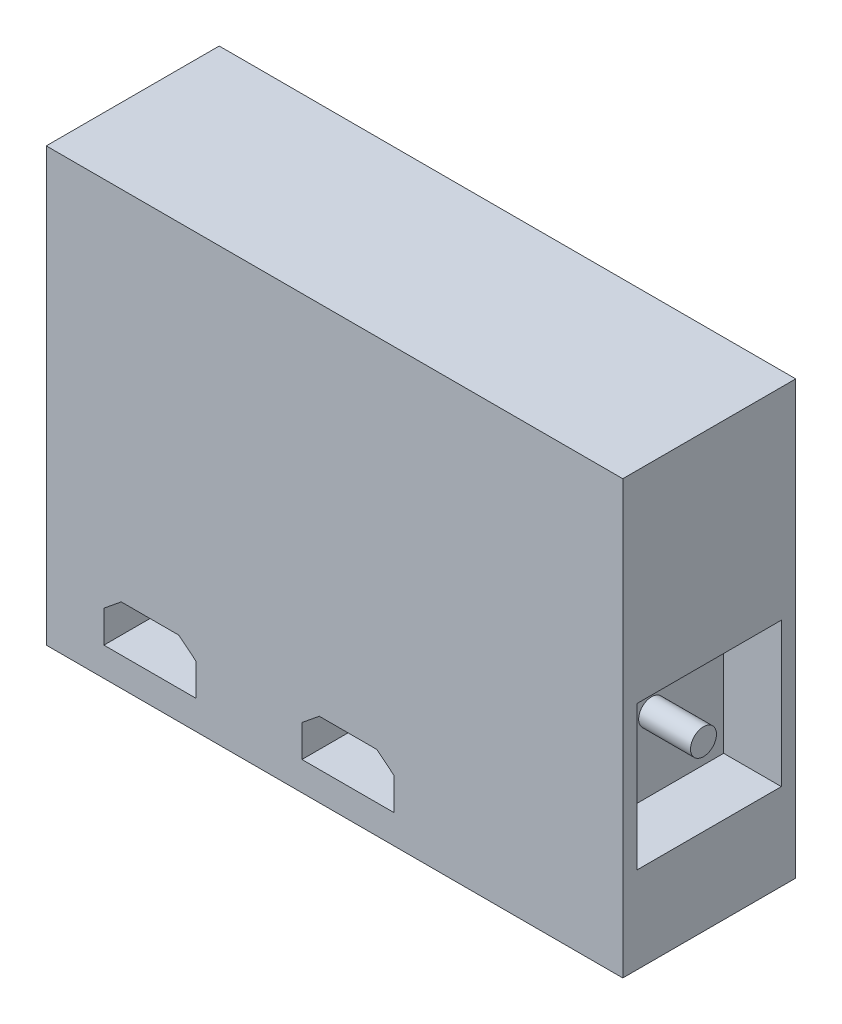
ISO-10303-21;
HEADER;
FILE_DESCRIPTION(('STEP AP214'),'2;1');
FILE_NAME('part.step','',(''),(''),'','','');
FILE_SCHEMA(('AUTOMOTIVE_DESIGN { 1 0 10303 214 1 1 1 1 }'));
ENDSEC;
DATA;
#1=APPLICATION_CONTEXT('core data for automotive mechanical design processes');
#2=APPLICATION_PROTOCOL_DEFINITION('international standard','automotive_design',2000,#1);
#3=PRODUCT_CONTEXT('',#1,'mechanical');
#4=PRODUCT('Part','Part','',(#3));
#5=PRODUCT_RELATED_PRODUCT_CATEGORY('part','',(#4));
#6=PRODUCT_DEFINITION_FORMATION('','',#4);
#7=PRODUCT_DEFINITION_CONTEXT('part definition',#1,'design');
#8=PRODUCT_DEFINITION('design','',#6,#7);
#9=PRODUCT_DEFINITION_SHAPE('','',#8);
#10=(LENGTH_UNIT() NAMED_UNIT(*) SI_UNIT(.MILLI.,.METRE.));
#11=(NAMED_UNIT(*) PLANE_ANGLE_UNIT() SI_UNIT($,.RADIAN.));
#12=(NAMED_UNIT(*) SI_UNIT($,.STERADIAN.) SOLID_ANGLE_UNIT());
#13=UNCERTAINTY_MEASURE_WITH_UNIT(LENGTH_MEASURE(1.E-05),#10,'distance_accuracy_value','');
#14=(GEOMETRIC_REPRESENTATION_CONTEXT(3) GLOBAL_UNCERTAINTY_ASSIGNED_CONTEXT((#13)) GLOBAL_UNIT_ASSIGNED_CONTEXT((#10,
#11,#12)) REPRESENTATION_CONTEXT('',''));
#15=CARTESIAN_POINT('',(0.,0.,0.));
#16=DIRECTION('',(0.,0.,1.));
#17=DIRECTION('',(1.,0.,0.));
#18=AXIS2_PLACEMENT_3D('',#15,#16,#17);
#19=CARTESIAN_POINT('',(40.0000000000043,-9.99999999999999,15.));
#20=DIRECTION('',(1.,0.,0.));
#21=DIRECTION('',(0.,0.,-1.));
#22=AXIS2_PLACEMENT_3D('',#19,#20,#21);
#23=CYLINDRICAL_SURFACE('',#22,2.25);
#24=CARTESIAN_POINT('',(40.0000000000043,-9.99999999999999,15.));
#25=DIRECTION('',(1.,0.,0.));
#26=DIRECTION('',(0.,0.,-1.));
#27=AXIS2_PLACEMENT_3D('',#24,#25,#26);
#28=CIRCLE('',#27,2.25);
#29=CARTESIAN_POINT('',(40.0000000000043,-9.99999999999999,12.75));
#30=VERTEX_POINT('',#29);
#31=EDGE_CURVE('E601',#30,#30,#28,.T.);
#32=ORIENTED_EDGE('',*,*,#31,.T.);
#33=EDGE_LOOP('',(#32));
#34=FACE_BOUND('',#33,.T.);
#35=CARTESIAN_POINT('',(49.,-9.99999999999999,15.));
#36=DIRECTION('',(1.,0.,0.));
#37=DIRECTION('',(0.,0.,-1.));
#38=AXIS2_PLACEMENT_3D('',#35,#36,#37);
#39=CIRCLE('',#38,2.25);
#40=CARTESIAN_POINT('',(49.,-9.99999999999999,12.75));
#41=VERTEX_POINT('',#40);
#42=EDGE_CURVE('E600',#41,#41,#39,.T.);
#43=ORIENTED_EDGE('',*,*,#42,.F.);
#44=EDGE_LOOP('',(#43));
#45=FACE_BOUND('',#44,.T.);
#46=ADVANCED_FACE('F30',(#34,#45),#23,.T.);
#47=CARTESIAN_POINT('',(-50.,37.5,30.));
#48=DIRECTION('',(0.,0.,1.));
#49=DIRECTION('',(1.,0.,0.));
#50=AXIS2_PLACEMENT_3D('',#47,#48,#49);
#51=PLANE('',#50);
#52=DIRECTION('',(-1.,0.,0.));
#53=VECTOR('',#52,1.);
#54=CARTESIAN_POINT('',(7.35254841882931,-24.5,30.));
#55=LINE('',#54,#53);
#56=CARTESIAN_POINT('',(7.35254841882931,-24.5,30.));
#57=VERTEX_POINT('',#56);
#58=CARTESIAN_POINT('',(-2.64745158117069,-24.5,30.));
#59=VERTEX_POINT('',#58);
#60=EDGE_CURVE('E53',#57,#59,#55,.T.);
#61=ORIENTED_EDGE('',*,*,#60,.F.);
#62=DIRECTION('',(-0.775465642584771,0.631389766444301,0.));
#63=VECTOR('',#62,1.);
#64=CARTESIAN_POINT('',(10.3525484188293,-26.9426218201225,30.));
#65=LINE('',#64,#63);
#66=CARTESIAN_POINT('',(10.3525484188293,-26.9426218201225,30.));
#67=VERTEX_POINT('',#66);
#68=EDGE_CURVE('E219',#67,#57,#65,.T.);
#69=ORIENTED_EDGE('',*,*,#68,.F.);
#70=DIRECTION('',(0.,-1.,0.));
#71=VECTOR('',#70,1.);
#72=CARTESIAN_POINT('',(10.3525484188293,-26.9426218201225,30.));
#73=LINE('',#72,#71);
#74=CARTESIAN_POINT('',(10.3525484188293,-32.5,30.));
#75=VERTEX_POINT('',#74);
#76=EDGE_CURVE('E216',#67,#75,#73,.T.);
#77=ORIENTED_EDGE('',*,*,#76,.T.);
#78=DIRECTION('',(1.,0.,0.));
#79=VECTOR('',#78,1.);
#80=CARTESIAN_POINT('',(-5.64745158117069,-32.5,30.));
#81=LINE('',#80,#79);
#82=CARTESIAN_POINT('',(-5.64745158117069,-32.5,30.));
#83=VERTEX_POINT('',#82);
#84=EDGE_CURVE('E213',#83,#75,#81,.T.);
#85=ORIENTED_EDGE('',*,*,#84,.F.);
#86=DIRECTION('',(0.,1.,0.));
#87=VECTOR('',#86,1.);
#88=CARTESIAN_POINT('',(-5.64745158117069,-32.5,30.));
#89=LINE('',#88,#87);
#90=CARTESIAN_POINT('',(-5.64745158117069,-26.9426218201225,30.));
#91=VERTEX_POINT('',#90);
#92=EDGE_CURVE('E210',#83,#91,#89,.T.);
#93=ORIENTED_EDGE('',*,*,#92,.T.);
#94=DIRECTION('',(-0.77546564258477,-0.631389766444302,0.));
#95=VECTOR('',#94,1.);
#96=CARTESIAN_POINT('',(-2.64745158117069,-24.5,30.));
#97=LINE('',#96,#95);
#98=EDGE_CURVE('E207',#59,#91,#97,.T.);
#99=ORIENTED_EDGE('',*,*,#98,.F.);
#100=EDGE_LOOP('',(#61,#69,#77,#85,#93,#99));
#101=FACE_BOUND('',#100,.T.);
#102=DIRECTION('',(0.,-1.,0.));
#103=VECTOR('',#102,1.);
#104=CARTESIAN_POINT('',(-50.,37.5,30.));
#105=LINE('',#104,#103);
#106=CARTESIAN_POINT('',(-50.,37.5,30.));
#107=VERTEX_POINT('',#106);
#108=CARTESIAN_POINT('',(-50.,-37.5,30.));
#109=VERTEX_POINT('',#108);
#110=EDGE_CURVE('E313',#107,#109,#105,.T.);
#111=ORIENTED_EDGE('',*,*,#110,.T.);
#112=DIRECTION('',(-1.,0.,0.));
#113=VECTOR('',#112,1.);
#114=CARTESIAN_POINT('',(50.,-37.5,30.));
#115=LINE('',#114,#113);
#116=CARTESIAN_POINT('',(50.,-37.5,30.));
#117=VERTEX_POINT('',#116);
#118=EDGE_CURVE('E316',#117,#109,#115,.T.);
#119=ORIENTED_EDGE('',*,*,#118,.F.);
#120=DIRECTION('',(0.,1.,0.));
#121=VECTOR('',#120,1.);
#122=CARTESIAN_POINT('',(50.,-37.5,30.));
#123=LINE('',#122,#121);
#124=CARTESIAN_POINT('',(50.,37.5,30.));
#125=VERTEX_POINT('',#124);
#126=EDGE_CURVE('E319',#117,#125,#123,.T.);
#127=ORIENTED_EDGE('',*,*,#126,.T.);
#128=DIRECTION('',(1.,0.,0.));
#129=VECTOR('',#128,1.);
#130=CARTESIAN_POINT('',(-50.,37.5,30.));
#131=LINE('',#130,#129);
#132=EDGE_CURVE('E322',#107,#125,#131,.T.);
#133=ORIENTED_EDGE('',*,*,#132,.F.);
#134=EDGE_LOOP('',(#111,#119,#127,#133));
#135=FACE_BOUND('',#134,.T.);
#136=DIRECTION('',(0.,-1.,0.));
#137=VECTOR('',#136,1.);
#138=CARTESIAN_POINT('',(-40.,-26.9426218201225,30.));
#139=LINE('',#138,#137);
#140=CARTESIAN_POINT('',(-40.,-26.9426218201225,30.));
#141=VERTEX_POINT('',#140);
#142=CARTESIAN_POINT('',(-40.,-32.5,30.));
#143=VERTEX_POINT('',#142);
#144=EDGE_CURVE('E267',#141,#143,#139,.T.);
#145=ORIENTED_EDGE('',*,*,#144,.F.);
#146=DIRECTION('',(0.775465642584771,0.631389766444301,0.));
#147=VECTOR('',#146,1.);
#148=CARTESIAN_POINT('',(-40.,-26.9426218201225,30.));
#149=LINE('',#148,#147);
#150=CARTESIAN_POINT('',(-37.,-24.5,30.));
#151=VERTEX_POINT('',#150);
#152=EDGE_CURVE('E252',#141,#151,#149,.T.);
#153=ORIENTED_EDGE('',*,*,#152,.T.);
#154=DIRECTION('',(1.,0.,0.));
#155=VECTOR('',#154,1.);
#156=CARTESIAN_POINT('',(-37.,-24.5,30.));
#157=LINE('',#156,#155);
#158=CARTESIAN_POINT('',(-27.,-24.5,30.));
#159=VERTEX_POINT('',#158);
#160=EDGE_CURVE('E255',#151,#159,#157,.T.);
#161=ORIENTED_EDGE('',*,*,#160,.T.);
#162=DIRECTION('',(0.77546564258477,-0.631389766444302,0.));
#163=VECTOR('',#162,1.);
#164=CARTESIAN_POINT('',(-27.,-24.5,30.));
#165=LINE('',#164,#163);
#166=CARTESIAN_POINT('',(-24.,-26.9426218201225,30.));
#167=VERTEX_POINT('',#166);
#168=EDGE_CURVE('E258',#159,#167,#165,.T.);
#169=ORIENTED_EDGE('',*,*,#168,.T.);
#170=DIRECTION('',(0.,1.,0.));
#171=VECTOR('',#170,1.);
#172=CARTESIAN_POINT('',(-24.,-32.5,30.));
#173=LINE('',#172,#171);
#174=CARTESIAN_POINT('',(-24.,-32.5,30.));
#175=VERTEX_POINT('',#174);
#176=EDGE_CURVE('E261',#175,#167,#173,.T.);
#177=ORIENTED_EDGE('',*,*,#176,.F.);
#178=DIRECTION('',(-1.,0.,0.));
#179=VECTOR('',#178,1.);
#180=CARTESIAN_POINT('',(-24.,-32.5,30.));
#181=LINE('',#180,#179);
#182=EDGE_CURVE('E264',#175,#143,#181,.T.);
#183=ORIENTED_EDGE('',*,*,#182,.T.);
#184=EDGE_LOOP('',(#145,#153,#161,#169,#177,#183));
#185=FACE_BOUND('',#184,.T.);
#186=ADVANCED_FACE('F342',(#101,#135,#185),#51,.T.);
#187=CARTESIAN_POINT('',(-50.,37.5,30.));
#188=DIRECTION('',(1.,0.,0.));
#189=DIRECTION('',(0.,0.,-1.));
#190=AXIS2_PLACEMENT_3D('',#187,#188,#189);
#191=PLANE('',#190);
#192=DIRECTION('',(0.,0.,-1.));
#193=VECTOR('',#192,1.);
#194=CARTESIAN_POINT('',(-50.,-37.5,30.));
#195=LINE('',#194,#193);
#196=CARTESIAN_POINT('',(-50.,-37.5,0.));
#197=VERTEX_POINT('',#196);
#198=EDGE_CURVE('E11',#109,#197,#195,.T.);
#199=ORIENTED_EDGE('',*,*,#198,.F.);
#200=ORIENTED_EDGE('',*,*,#110,.F.);
#201=DIRECTION('',(0.,0.,-1.));
#202=VECTOR('',#201,1.);
#203=CARTESIAN_POINT('',(-50.,37.5,30.));
#204=LINE('',#203,#202);
#205=CARTESIAN_POINT('',(-50.,37.5,0.));
#206=VERTEX_POINT('',#205);
#207=EDGE_CURVE('E325',#107,#206,#204,.T.);
#208=ORIENTED_EDGE('',*,*,#207,.T.);
#209=DIRECTION('',(0.,-1.,0.));
#210=VECTOR('',#209,1.);
#211=CARTESIAN_POINT('',(-50.,37.5,0.));
#212=LINE('',#211,#210);
#213=EDGE_CURVE('E301',#206,#197,#212,.T.);
#214=ORIENTED_EDGE('',*,*,#213,.T.);
#215=EDGE_LOOP('',(#199,#200,#208,#214));
#216=FACE_BOUND('',#215,.T.);
#217=ADVANCED_FACE('F345',(#216),#191,.F.);
#218=CARTESIAN_POINT('',(50.,-37.5,30.));
#219=DIRECTION('',(0.,-1.,0.));
#220=DIRECTION('',(1.,0.,0.));
#221=AXIS2_PLACEMENT_3D('',#218,#219,#220);
#222=PLANE('',#221);
#223=DIRECTION('',(0.,0.,-1.));
#224=VECTOR('',#223,1.);
#225=CARTESIAN_POINT('',(50.,-37.5,30.));
#226=LINE('',#225,#224);
#227=CARTESIAN_POINT('',(50.,-37.5,0.));
#228=VERTEX_POINT('',#227);
#229=EDGE_CURVE('E38',#117,#228,#226,.T.);
#230=ORIENTED_EDGE('',*,*,#229,.F.);
#231=ORIENTED_EDGE('',*,*,#118,.T.);
#232=ORIENTED_EDGE('',*,*,#198,.T.);
#233=DIRECTION('',(-1.,0.,0.));
#234=VECTOR('',#233,1.);
#235=CARTESIAN_POINT('',(50.,-37.5,0.));
#236=LINE('',#235,#234);
#237=EDGE_CURVE('E304',#228,#197,#236,.T.);
#238=ORIENTED_EDGE('',*,*,#237,.F.);
#239=EDGE_LOOP('',(#230,#231,#232,#238));
#240=FACE_BOUND('',#239,.T.);
#241=ADVANCED_FACE('F32',(#240),#222,.T.);
#242=CARTESIAN_POINT('',(50.,-37.5,30.));
#243=DIRECTION('',(-1.,0.,0.));
#244=DIRECTION('',(0.,0.,1.));
#245=AXIS2_PLACEMENT_3D('',#242,#243,#244);
#246=PLANE('',#245);
#247=DIRECTION('',(0.,0.,1.));
#248=VECTOR('',#247,1.);
#249=CARTESIAN_POINT('',(50.0000000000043,-22.5,2.50000000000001));
#250=LINE('',#249,#248);
#251=CARTESIAN_POINT('',(50.0000000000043,-22.5,2.50000000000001));
#252=VERTEX_POINT('',#251);
#253=CARTESIAN_POINT('',(50.,-22.5,27.5));
#254=VERTEX_POINT('',#253);
#255=EDGE_CURVE('E181',#252,#254,#250,.T.);
#256=ORIENTED_EDGE('',*,*,#255,.T.);
#257=DIRECTION('',(0.,-1.,0.));
#258=VECTOR('',#257,1.);
#259=CARTESIAN_POINT('',(50.0000000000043,2.50000000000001,27.5));
#260=LINE('',#259,#258);
#261=CARTESIAN_POINT('',(50.0000000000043,2.50000000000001,27.5));
#262=VERTEX_POINT('',#261);
#263=EDGE_CURVE('E45',#262,#254,#260,.T.);
#264=ORIENTED_EDGE('',*,*,#263,.F.);
#265=DIRECTION('',(0.,0.,-1.));
#266=VECTOR('',#265,1.);
#267=CARTESIAN_POINT('',(50.0000000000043,2.50000000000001,27.5));
#268=LINE('',#267,#266);
#269=CARTESIAN_POINT('',(50.0000000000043,2.50000000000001,2.50000000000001));
#270=VERTEX_POINT('',#269);
#271=EDGE_CURVE('E188',#262,#270,#268,.T.);
#272=ORIENTED_EDGE('',*,*,#271,.T.);
#273=DIRECTION('',(0.,1.,0.));
#274=VECTOR('',#273,1.);
#275=CARTESIAN_POINT('',(50.0000000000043,-22.5,2.50000000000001));
#276=LINE('',#275,#274);
#277=EDGE_CURVE('E170',#252,#270,#276,.T.);
#278=ORIENTED_EDGE('',*,*,#277,.F.);
#279=EDGE_LOOP('',(#256,#264,#272,#278));
#280=FACE_BOUND('',#279,.T.);
#281=DIRECTION('',(0.,0.,-1.));
#282=VECTOR('',#281,1.);
#283=CARTESIAN_POINT('',(50.,37.5,30.));
#284=LINE('',#283,#282);
#285=CARTESIAN_POINT('',(50.,37.5,0.));
#286=VERTEX_POINT('',#285);
#287=EDGE_CURVE('E327',#125,#286,#284,.T.);
#288=ORIENTED_EDGE('',*,*,#287,.F.);
#289=ORIENTED_EDGE('',*,*,#126,.F.);
#290=ORIENTED_EDGE('',*,*,#229,.T.);
#291=DIRECTION('',(0.,1.,0.));
#292=VECTOR('',#291,1.);
#293=CARTESIAN_POINT('',(50.,-37.5,0.));
#294=LINE('',#293,#292);
#295=EDGE_CURVE('E307',#228,#286,#294,.T.);
#296=ORIENTED_EDGE('',*,*,#295,.T.);
#297=EDGE_LOOP('',(#288,#289,#290,#296));
#298=FACE_BOUND('',#297,.T.);
#299=ADVANCED_FACE('F185',(#280,#298),#246,.F.);
#300=CARTESIAN_POINT('',(-50.,37.5,30.));
#301=DIRECTION('',(0.,1.,0.));
#302=DIRECTION('',(0.,0.,1.));
#303=AXIS2_PLACEMENT_3D('',#300,#301,#302);
#304=PLANE('',#303);
#305=ORIENTED_EDGE('',*,*,#132,.T.);
#306=ORIENTED_EDGE('',*,*,#287,.T.);
#307=DIRECTION('',(1.,0.,0.));
#308=VECTOR('',#307,1.);
#309=CARTESIAN_POINT('',(-50.,37.5,0.));
#310=LINE('',#309,#308);
#311=EDGE_CURVE('E310',#206,#286,#310,.T.);
#312=ORIENTED_EDGE('',*,*,#311,.F.);
#313=ORIENTED_EDGE('',*,*,#207,.F.);
#314=EDGE_LOOP('',(#305,#306,#312,#313));
#315=FACE_BOUND('',#314,.T.);
#316=ADVANCED_FACE('F338',(#315),#304,.T.);
#317=CARTESIAN_POINT('',(-50.,37.5,0.));
#318=DIRECTION('',(0.,0.,1.));
#319=DIRECTION('',(1.,0.,0.));
#320=AXIS2_PLACEMENT_3D('',#317,#318,#319);
#321=PLANE('',#320);
#322=ORIENTED_EDGE('',*,*,#213,.F.);
#323=ORIENTED_EDGE('',*,*,#311,.T.);
#324=ORIENTED_EDGE('',*,*,#295,.F.);
#325=ORIENTED_EDGE('',*,*,#237,.T.);
#326=EDGE_LOOP('',(#322,#323,#324,#325));
#327=FACE_BOUND('',#326,.T.);
#328=ADVANCED_FACE('F335',(#327),#321,.F.);
#329=CARTESIAN_POINT('',(-40.,-26.9426218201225,10.));
#330=DIRECTION('',(0.631389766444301,-0.775465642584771,0.));
#331=DIRECTION('',(0.775465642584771,0.631389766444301,0.));
#332=AXIS2_PLACEMENT_3D('',#329,#330,#331);
#333=PLANE('',#332);
#334=DIRECTION('',(0.,0.,1.));
#335=VECTOR('',#334,1.);
#336=CARTESIAN_POINT('',(-37.,-24.5,10.));
#337=LINE('',#336,#335);
#338=CARTESIAN_POINT('',(-37.,-24.5,10.));
#339=VERTEX_POINT('',#338);
#340=EDGE_CURVE('E299',#339,#151,#337,.T.);
#341=ORIENTED_EDGE('',*,*,#340,.T.);
#342=ORIENTED_EDGE('',*,*,#152,.F.);
#343=DIRECTION('',(0.,0.,1.));
#344=VECTOR('',#343,1.);
#345=CARTESIAN_POINT('',(-40.,-26.9426218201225,10.));
#346=LINE('',#345,#344);
#347=CARTESIAN_POINT('',(-40.,-26.9426218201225,10.));
#348=VERTEX_POINT('',#347);
#349=EDGE_CURVE('E288',#348,#141,#346,.T.);
#350=ORIENTED_EDGE('',*,*,#349,.F.);
#351=DIRECTION('',(0.775465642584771,0.631389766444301,0.));
#352=VECTOR('',#351,1.);
#353=CARTESIAN_POINT('',(-40.,-26.9426218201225,10.));
#354=LINE('',#353,#352);
#355=EDGE_CURVE('E270',#348,#339,#354,.T.);
#356=ORIENTED_EDGE('',*,*,#355,.T.);
#357=EDGE_LOOP('',(#341,#342,#350,#356));
#358=FACE_BOUND('',#357,.T.);
#359=ADVANCED_FACE('F413',(#358),#333,.T.);
#360=CARTESIAN_POINT('',(-37.,-24.5,10.));
#361=DIRECTION('',(0.,-1.,0.));
#362=DIRECTION('',(0.,0.,-1.));
#363=AXIS2_PLACEMENT_3D('',#360,#361,#362);
#364=PLANE('',#363);
#365=DIRECTION('',(0.,0.,1.));
#366=VECTOR('',#365,1.);
#367=CARTESIAN_POINT('',(-27.,-24.5,10.));
#368=LINE('',#367,#366);
#369=CARTESIAN_POINT('',(-27.,-24.5,10.));
#370=VERTEX_POINT('',#369);
#371=EDGE_CURVE('E297',#370,#159,#368,.T.);
#372=ORIENTED_EDGE('',*,*,#371,.T.);
#373=ORIENTED_EDGE('',*,*,#160,.F.);
#374=ORIENTED_EDGE('',*,*,#340,.F.);
#375=DIRECTION('',(1.,0.,0.));
#376=VECTOR('',#375,1.);
#377=CARTESIAN_POINT('',(-37.,-24.5,10.));
#378=LINE('',#377,#376);
#379=EDGE_CURVE('E273',#339,#370,#378,.T.);
#380=ORIENTED_EDGE('',*,*,#379,.T.);
#381=EDGE_LOOP('',(#372,#373,#374,#380));
#382=FACE_BOUND('',#381,.T.);
#383=ADVANCED_FACE('F416',(#382),#364,.T.);
#384=CARTESIAN_POINT('',(-27.,-24.5,10.));
#385=DIRECTION('',(-0.631389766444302,-0.77546564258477,0.));
#386=DIRECTION('',(0.77546564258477,-0.631389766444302,0.));
#387=AXIS2_PLACEMENT_3D('',#384,#385,#386);
#388=PLANE('',#387);
#389=DIRECTION('',(0.,0.,1.));
#390=VECTOR('',#389,1.);
#391=CARTESIAN_POINT('',(-24.,-26.9426218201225,10.));
#392=LINE('',#391,#390);
#393=CARTESIAN_POINT('',(-24.,-26.9426218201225,10.));
#394=VERTEX_POINT('',#393);
#395=EDGE_CURVE('E295',#394,#167,#392,.T.);
#396=ORIENTED_EDGE('',*,*,#395,.T.);
#397=ORIENTED_EDGE('',*,*,#168,.F.);
#398=ORIENTED_EDGE('',*,*,#371,.F.);
#399=DIRECTION('',(0.77546564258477,-0.631389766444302,0.));
#400=VECTOR('',#399,1.);
#401=CARTESIAN_POINT('',(-27.,-24.5,10.));
#402=LINE('',#401,#400);
#403=EDGE_CURVE('E276',#370,#394,#402,.T.);
#404=ORIENTED_EDGE('',*,*,#403,.T.);
#405=EDGE_LOOP('',(#396,#397,#398,#404));
#406=FACE_BOUND('',#405,.T.);
#407=ADVANCED_FACE('F427',(#406),#388,.T.);
#408=CARTESIAN_POINT('',(-24.,-32.5,10.));
#409=DIRECTION('',(1.,0.,0.));
#410=DIRECTION('',(0.,0.,-1.));
#411=AXIS2_PLACEMENT_3D('',#408,#409,#410);
#412=PLANE('',#411);
#413=DIRECTION('',(0.,0.,1.));
#414=VECTOR('',#413,1.);
#415=CARTESIAN_POINT('',(-24.,-32.5,10.));
#416=LINE('',#415,#414);
#417=CARTESIAN_POINT('',(-24.,-32.5,10.));
#418=VERTEX_POINT('',#417);
#419=EDGE_CURVE('E293',#418,#175,#416,.T.);
#420=ORIENTED_EDGE('',*,*,#419,.T.);
#421=ORIENTED_EDGE('',*,*,#176,.T.);
#422=ORIENTED_EDGE('',*,*,#395,.F.);
#423=DIRECTION('',(0.,1.,0.));
#424=VECTOR('',#423,1.);
#425=CARTESIAN_POINT('',(-24.,-32.5,10.));
#426=LINE('',#425,#424);
#427=EDGE_CURVE('E279',#418,#394,#426,.T.);
#428=ORIENTED_EDGE('',*,*,#427,.F.);
#429=EDGE_LOOP('',(#420,#421,#422,#428));
#430=FACE_BOUND('',#429,.T.);
#431=ADVANCED_FACE('F423',(#430),#412,.F.);
#432=CARTESIAN_POINT('',(-24.,-32.5,10.));
#433=DIRECTION('',(0.,1.,0.));
#434=DIRECTION('',(0.,0.,1.));
#435=AXIS2_PLACEMENT_3D('',#432,#433,#434);
#436=PLANE('',#435);
#437=DIRECTION('',(0.,0.,1.));
#438=VECTOR('',#437,1.);
#439=CARTESIAN_POINT('',(-40.,-32.5,10.));
#440=LINE('',#439,#438);
#441=CARTESIAN_POINT('',(-40.,-32.5,10.));
#442=VERTEX_POINT('',#441);
#443=EDGE_CURVE('E291',#442,#143,#440,.T.);
#444=ORIENTED_EDGE('',*,*,#443,.T.);
#445=ORIENTED_EDGE('',*,*,#182,.F.);
#446=ORIENTED_EDGE('',*,*,#419,.F.);
#447=DIRECTION('',(-1.,0.,0.));
#448=VECTOR('',#447,1.);
#449=CARTESIAN_POINT('',(-24.,-32.5,10.));
#450=LINE('',#449,#448);
#451=EDGE_CURVE('E282',#418,#442,#450,.T.);
#452=ORIENTED_EDGE('',*,*,#451,.T.);
#453=EDGE_LOOP('',(#444,#445,#446,#452));
#454=FACE_BOUND('',#453,.T.);
#455=ADVANCED_FACE('F412',(#454),#436,.T.);
#456=CARTESIAN_POINT('',(-40.,-26.9426218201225,10.));
#457=DIRECTION('',(-1.,0.,0.));
#458=DIRECTION('',(0.,0.,1.));
#459=AXIS2_PLACEMENT_3D('',#456,#457,#458);
#460=PLANE('',#459);
#461=DIRECTION('',(0.,-1.,0.));
#462=VECTOR('',#461,1.);
#463=CARTESIAN_POINT('',(-40.,-26.9426218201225,10.));
#464=LINE('',#463,#462);
#465=EDGE_CURVE('E285',#348,#442,#464,.T.);
#466=ORIENTED_EDGE('',*,*,#465,.F.);
#467=ORIENTED_EDGE('',*,*,#349,.T.);
#468=ORIENTED_EDGE('',*,*,#144,.T.);
#469=ORIENTED_EDGE('',*,*,#443,.F.);
#470=EDGE_LOOP('',(#466,#467,#468,#469));
#471=FACE_BOUND('',#470,.T.);
#472=ADVANCED_FACE('F391',(#471),#460,.F.);
#473=CARTESIAN_POINT('',(-32.,-20.4289636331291,10.));
#474=DIRECTION('',(0.,0.,-1.));
#475=DIRECTION('',(-1.,0.,0.));
#476=AXIS2_PLACEMENT_3D('',#473,#474,#475);
#477=PLANE('',#476);
#478=ORIENTED_EDGE('',*,*,#355,.F.);
#479=ORIENTED_EDGE('',*,*,#465,.T.);
#480=ORIENTED_EDGE('',*,*,#451,.F.);
#481=ORIENTED_EDGE('',*,*,#427,.T.);
#482=ORIENTED_EDGE('',*,*,#403,.F.);
#483=ORIENTED_EDGE('',*,*,#379,.F.);
#484=EDGE_LOOP('',(#478,#479,#480,#481,#482,#483));
#485=FACE_BOUND('',#484,.T.);
#486=ADVANCED_FACE('F390',(#485),#477,.F.);
#487=CARTESIAN_POINT('',(7.35254841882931,-24.5,10.));
#488=DIRECTION('',(0.,1.,0.));
#489=DIRECTION('',(-1.,0.,0.));
#490=AXIS2_PLACEMENT_3D('',#487,#488,#489);
#491=PLANE('',#490);
#492=DIRECTION('',(0.,0.,1.));
#493=VECTOR('',#492,1.);
#494=CARTESIAN_POINT('',(7.35254841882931,-24.5,10.));
#495=LINE('',#494,#493);
#496=CARTESIAN_POINT('',(7.35254841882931,-24.5,10.));
#497=VERTEX_POINT('',#496);
#498=EDGE_CURVE('E250',#497,#57,#495,.T.);
#499=ORIENTED_EDGE('',*,*,#498,.T.);
#500=ORIENTED_EDGE('',*,*,#60,.T.);
#501=DIRECTION('',(0.,0.,1.));
#502=VECTOR('',#501,1.);
#503=CARTESIAN_POINT('',(-2.64745158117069,-24.5,10.));
#504=LINE('',#503,#502);
#505=CARTESIAN_POINT('',(-2.64745158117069,-24.5,10.));
#506=VERTEX_POINT('',#505);
#507=EDGE_CURVE('E240',#506,#59,#504,.T.);
#508=ORIENTED_EDGE('',*,*,#507,.F.);
#509=DIRECTION('',(-1.,0.,0.));
#510=VECTOR('',#509,1.);
#511=CARTESIAN_POINT('',(7.35254841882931,-24.5,10.));
#512=LINE('',#511,#510);
#513=EDGE_CURVE('E222',#497,#506,#512,.T.);
#514=ORIENTED_EDGE('',*,*,#513,.F.);
#515=EDGE_LOOP('',(#499,#500,#508,#514));
#516=FACE_BOUND('',#515,.T.);
#517=ADVANCED_FACE('F386',(#516),#491,.F.);
#518=CARTESIAN_POINT('',(10.3525484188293,-26.9426218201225,10.));
#519=DIRECTION('',(0.631389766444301,0.775465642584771,0.));
#520=DIRECTION('',(-0.775465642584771,0.631389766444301,0.));
#521=AXIS2_PLACEMENT_3D('',#518,#519,#520);
#522=PLANE('',#521);
#523=DIRECTION('',(0.,0.,1.));
#524=VECTOR('',#523,1.);
#525=CARTESIAN_POINT('',(10.3525484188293,-26.9426218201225,10.));
#526=LINE('',#525,#524);
#527=CARTESIAN_POINT('',(10.3525484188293,-26.9426218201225,10.));
#528=VERTEX_POINT('',#527);
#529=EDGE_CURVE('E248',#528,#67,#526,.T.);
#530=ORIENTED_EDGE('',*,*,#529,.T.);
#531=ORIENTED_EDGE('',*,*,#68,.T.);
#532=ORIENTED_EDGE('',*,*,#498,.F.);
#533=DIRECTION('',(-0.775465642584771,0.631389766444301,0.));
#534=VECTOR('',#533,1.);
#535=CARTESIAN_POINT('',(10.3525484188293,-26.9426218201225,10.));
#536=LINE('',#535,#534);
#537=EDGE_CURVE('E237',#528,#497,#536,.T.);
#538=ORIENTED_EDGE('',*,*,#537,.F.);
#539=EDGE_LOOP('',(#530,#531,#532,#538));
#540=FACE_BOUND('',#539,.T.);
#541=ADVANCED_FACE('F389',(#540),#522,.F.);
#542=CARTESIAN_POINT('',(10.3525484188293,-26.9426218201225,10.));
#543=DIRECTION('',(-1.,0.,0.));
#544=DIRECTION('',(0.,0.,1.));
#545=AXIS2_PLACEMENT_3D('',#542,#543,#544);
#546=PLANE('',#545);
#547=DIRECTION('',(0.,0.,1.));
#548=VECTOR('',#547,1.);
#549=CARTESIAN_POINT('',(10.3525484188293,-32.5,10.));
#550=LINE('',#549,#548);
#551=CARTESIAN_POINT('',(10.3525484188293,-32.5,10.));
#552=VERTEX_POINT('',#551);
#553=EDGE_CURVE('E246',#552,#75,#550,.T.);
#554=ORIENTED_EDGE('',*,*,#553,.T.);
#555=ORIENTED_EDGE('',*,*,#76,.F.);
#556=ORIENTED_EDGE('',*,*,#529,.F.);
#557=DIRECTION('',(0.,-1.,0.));
#558=VECTOR('',#557,1.);
#559=CARTESIAN_POINT('',(10.3525484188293,-26.9426218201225,10.));
#560=LINE('',#559,#558);
#561=EDGE_CURVE('E234',#528,#552,#560,.T.);
#562=ORIENTED_EDGE('',*,*,#561,.T.);
#563=EDGE_LOOP('',(#554,#555,#556,#562));
#564=FACE_BOUND('',#563,.T.);
#565=ADVANCED_FACE('F401',(#564),#546,.T.);
#566=CARTESIAN_POINT('',(-5.64745158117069,-32.5,10.));
#567=DIRECTION('',(0.,-1.,0.));
#568=DIRECTION('',(1.,0.,0.));
#569=AXIS2_PLACEMENT_3D('',#566,#567,#568);
#570=PLANE('',#569);
#571=DIRECTION('',(0.,0.,1.));
#572=VECTOR('',#571,1.);
#573=CARTESIAN_POINT('',(-5.64745158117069,-32.5,10.));
#574=LINE('',#573,#572);
#575=CARTESIAN_POINT('',(-5.64745158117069,-32.5,10.));
#576=VERTEX_POINT('',#575);
#577=EDGE_CURVE('E244',#576,#83,#574,.T.);
#578=ORIENTED_EDGE('',*,*,#577,.T.);
#579=ORIENTED_EDGE('',*,*,#84,.T.);
#580=ORIENTED_EDGE('',*,*,#553,.F.);
#581=DIRECTION('',(1.,0.,0.));
#582=VECTOR('',#581,1.);
#583=CARTESIAN_POINT('',(-5.64745158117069,-32.5,10.));
#584=LINE('',#583,#582);
#585=EDGE_CURVE('E231',#576,#552,#584,.T.);
#586=ORIENTED_EDGE('',*,*,#585,.F.);
#587=EDGE_LOOP('',(#578,#579,#580,#586));
#588=FACE_BOUND('',#587,.T.);
#589=ADVANCED_FACE('F397',(#588),#570,.F.);
#590=CARTESIAN_POINT('',(-5.64745158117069,-32.5,10.));
#591=DIRECTION('',(1.,0.,0.));
#592=DIRECTION('',(0.,0.,-1.));
#593=AXIS2_PLACEMENT_3D('',#590,#591,#592);
#594=PLANE('',#593);
#595=DIRECTION('',(0.,0.,1.));
#596=VECTOR('',#595,1.);
#597=CARTESIAN_POINT('',(-5.64745158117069,-26.9426218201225,10.));
#598=LINE('',#597,#596);
#599=CARTESIAN_POINT('',(-5.64745158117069,-26.9426218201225,10.));
#600=VERTEX_POINT('',#599);
#601=EDGE_CURVE('E242',#600,#91,#598,.T.);
#602=ORIENTED_EDGE('',*,*,#601,.T.);
#603=ORIENTED_EDGE('',*,*,#92,.F.);
#604=ORIENTED_EDGE('',*,*,#577,.F.);
#605=DIRECTION('',(0.,1.,0.));
#606=VECTOR('',#605,1.);
#607=CARTESIAN_POINT('',(-5.64745158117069,-32.5,10.));
#608=LINE('',#607,#606);
#609=EDGE_CURVE('E228',#576,#600,#608,.T.);
#610=ORIENTED_EDGE('',*,*,#609,.T.);
#611=EDGE_LOOP('',(#602,#603,#604,#610));
#612=FACE_BOUND('',#611,.T.);
#613=ADVANCED_FACE('F385',(#612),#594,.T.);
#614=CARTESIAN_POINT('',(-2.64745158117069,-24.5,10.));
#615=DIRECTION('',(-0.631389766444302,0.77546564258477,0.));
#616=DIRECTION('',(-0.77546564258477,-0.631389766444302,0.));
#617=AXIS2_PLACEMENT_3D('',#614,#615,#616);
#618=PLANE('',#617);
#619=DIRECTION('',(-0.77546564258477,-0.631389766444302,0.));
#620=VECTOR('',#619,1.);
#621=CARTESIAN_POINT('',(-2.64745158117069,-24.5,10.));
#622=LINE('',#621,#620);
#623=EDGE_CURVE('E225',#506,#600,#622,.T.);
#624=ORIENTED_EDGE('',*,*,#623,.F.);
#625=ORIENTED_EDGE('',*,*,#507,.T.);
#626=ORIENTED_EDGE('',*,*,#98,.T.);
#627=ORIENTED_EDGE('',*,*,#601,.F.);
#628=EDGE_LOOP('',(#624,#625,#626,#627));
#629=FACE_BOUND('',#628,.T.);
#630=ADVANCED_FACE('F374',(#629),#618,.F.);
#631=CARTESIAN_POINT('',(-5.64745158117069,-24.5,10.));
#632=DIRECTION('',(0.,0.,-1.));
#633=DIRECTION('',(-1.,0.,0.));
#634=AXIS2_PLACEMENT_3D('',#631,#632,#633);
#635=PLANE('',#634);
#636=ORIENTED_EDGE('',*,*,#513,.T.);
#637=ORIENTED_EDGE('',*,*,#623,.T.);
#638=ORIENTED_EDGE('',*,*,#609,.F.);
#639=ORIENTED_EDGE('',*,*,#585,.T.);
#640=ORIENTED_EDGE('',*,*,#561,.F.);
#641=ORIENTED_EDGE('',*,*,#537,.T.);
#642=EDGE_LOOP('',(#636,#637,#638,#639,#640,#641));
#643=FACE_BOUND('',#642,.T.);
#644=ADVANCED_FACE('F373',(#643),#635,.F.);
#645=CARTESIAN_POINT('',(40.0000000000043,2.50000000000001,27.5));
#646=DIRECTION('',(0.,0.,1.));
#647=DIRECTION('',(0.,-1.,0.));
#648=AXIS2_PLACEMENT_3D('',#645,#646,#647);
#649=PLANE('',#648);
#650=DIRECTION('',(1.,0.,0.));
#651=VECTOR('',#650,1.);
#652=CARTESIAN_POINT('',(40.0000000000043,2.50000000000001,27.5));
#653=LINE('',#652,#651);
#654=CARTESIAN_POINT('',(40.0000000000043,2.50000000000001,27.5));
#655=VERTEX_POINT('',#654);
#656=EDGE_CURVE('E204',#655,#262,#653,.T.);
#657=ORIENTED_EDGE('',*,*,#656,.T.);
#658=ORIENTED_EDGE('',*,*,#263,.T.);
#659=DIRECTION('',(1.,0.,0.));
#660=VECTOR('',#659,1.);
#661=CARTESIAN_POINT('',(40.0000000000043,-22.5,27.5));
#662=LINE('',#661,#660);
#663=CARTESIAN_POINT('',(40.0000000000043,-22.5,27.5));
#664=VERTEX_POINT('',#663);
#665=EDGE_CURVE('E178',#664,#254,#662,.T.);
#666=ORIENTED_EDGE('',*,*,#665,.F.);
#667=DIRECTION('',(0.,-1.,0.));
#668=VECTOR('',#667,1.);
#669=CARTESIAN_POINT('',(40.0000000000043,2.50000000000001,27.5));
#670=LINE('',#669,#668);
#671=EDGE_CURVE('E190',#655,#664,#670,.T.);
#672=ORIENTED_EDGE('',*,*,#671,.F.);
#673=EDGE_LOOP('',(#657,#658,#666,#672));
#674=FACE_BOUND('',#673,.T.);
#675=ADVANCED_FACE('F369',(#674),#649,.F.);
#676=CARTESIAN_POINT('',(40.0000000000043,2.50000000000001,27.5));
#677=DIRECTION('',(0.,-1.,0.));
#678=DIRECTION('',(0.,0.,-1.));
#679=AXIS2_PLACEMENT_3D('',#676,#677,#678);
#680=PLANE('',#679);
#681=DIRECTION('',(1.,0.,0.));
#682=VECTOR('',#681,1.);
#683=CARTESIAN_POINT('',(40.0000000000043,2.50000000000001,2.50000000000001));
#684=LINE('',#683,#682);
#685=CARTESIAN_POINT('',(40.0000000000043,2.50000000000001,2.50000000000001));
#686=VERTEX_POINT('',#685);
#687=EDGE_CURVE('E177',#686,#270,#684,.T.);
#688=ORIENTED_EDGE('',*,*,#687,.T.);
#689=ORIENTED_EDGE('',*,*,#271,.F.);
#690=ORIENTED_EDGE('',*,*,#656,.F.);
#691=DIRECTION('',(0.,0.,-1.));
#692=VECTOR('',#691,1.);
#693=CARTESIAN_POINT('',(40.0000000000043,2.50000000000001,27.5));
#694=LINE('',#693,#692);
#695=EDGE_CURVE('E199',#655,#686,#694,.T.);
#696=ORIENTED_EDGE('',*,*,#695,.T.);
#697=EDGE_LOOP('',(#688,#689,#690,#696));
#698=FACE_BOUND('',#697,.T.);
#699=ADVANCED_FACE('F372',(#698),#680,.T.);
#700=CARTESIAN_POINT('',(40.0000000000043,-22.5,2.50000000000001));
#701=DIRECTION('',(0.,0.,-1.));
#702=DIRECTION('',(-1.,0.,0.));
#703=AXIS2_PLACEMENT_3D('',#700,#701,#702);
#704=PLANE('',#703);
#705=DIRECTION('',(1.,0.,0.));
#706=VECTOR('',#705,1.);
#707=CARTESIAN_POINT('',(40.0000000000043,-22.5,2.50000000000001));
#708=LINE('',#707,#706);
#709=CARTESIAN_POINT('',(40.0000000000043,-22.5,2.50000000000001));
#710=VERTEX_POINT('',#709);
#711=EDGE_CURVE('E166',#710,#252,#708,.T.);
#712=ORIENTED_EDGE('',*,*,#711,.T.);
#713=ORIENTED_EDGE('',*,*,#277,.T.);
#714=ORIENTED_EDGE('',*,*,#687,.F.);
#715=DIRECTION('',(0.,1.,0.));
#716=VECTOR('',#715,1.);
#717=CARTESIAN_POINT('',(40.0000000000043,-22.5,2.50000000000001));
#718=LINE('',#717,#716);
#719=EDGE_CURVE('E173',#710,#686,#718,.T.);
#720=ORIENTED_EDGE('',*,*,#719,.F.);
#721=EDGE_LOOP('',(#712,#713,#714,#720));
#722=FACE_BOUND('',#721,.T.);
#723=ADVANCED_FACE('F168',(#722),#704,.F.);
#724=CARTESIAN_POINT('',(40.0000000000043,-22.5,2.50000000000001));
#725=DIRECTION('',(0.,1.,0.));
#726=DIRECTION('',(0.,0.,1.));
#727=AXIS2_PLACEMENT_3D('',#724,#725,#726);
#728=PLANE('',#727);
#729=DIRECTION('',(0.,0.,1.));
#730=VECTOR('',#729,1.);
#731=CARTESIAN_POINT('',(40.0000000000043,-22.5,2.50000000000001));
#732=LINE('',#731,#730);
#733=EDGE_CURVE('E196',#710,#664,#732,.T.);
#734=ORIENTED_EDGE('',*,*,#733,.T.);
#735=ORIENTED_EDGE('',*,*,#665,.T.);
#736=ORIENTED_EDGE('',*,*,#255,.F.);
#737=ORIENTED_EDGE('',*,*,#711,.F.);
#738=EDGE_LOOP('',(#734,#735,#736,#737));
#739=FACE_BOUND('',#738,.T.);
#740=ADVANCED_FACE('F182',(#739),#728,.T.);
#741=CARTESIAN_POINT('',(40.0000000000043,-22.5,27.5));
#742=DIRECTION('',(-1.,0.,0.));
#743=DIRECTION('',(0.,0.,1.));
#744=AXIS2_PLACEMENT_3D('',#741,#742,#743);
#745=PLANE('',#744);
#746=ORIENTED_EDGE('',*,*,#31,.F.);
#747=EDGE_LOOP('',(#746));
#748=FACE_BOUND('',#747,.T.);
#749=ORIENTED_EDGE('',*,*,#671,.T.);
#750=ORIENTED_EDGE('',*,*,#733,.F.);
#751=ORIENTED_EDGE('',*,*,#719,.T.);
#752=ORIENTED_EDGE('',*,*,#695,.F.);
#753=EDGE_LOOP('',(#749,#750,#751,#752));
#754=FACE_BOUND('',#753,.T.);
#755=ADVANCED_FACE('F365',(#748,#754),#745,.F.);
#756=CARTESIAN_POINT('',(49.,-9.99999999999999,15.));
#757=DIRECTION('',(1.,0.,0.));
#758=DIRECTION('',(0.,0.,-1.));
#759=AXIS2_PLACEMENT_3D('',#756,#757,#758);
#760=PLANE('',#759);
#761=ORIENTED_EDGE('',*,*,#42,.T.);
#762=EDGE_LOOP('',(#761));
#763=FACE_BOUND('',#762,.T.);
#764=ADVANCED_FACE('F364',(#763),#760,.T.);
#765=CLOSED_SHELL('',(#46,#186,#217,#241,#299,#316,#328,#359,#383,#407,#431,#455,#472,#486,#517,
#541,#565,#589,#613,#630,#644,#675,#699,#723,#740,#755,#764));
#766=MANIFOLD_SOLID_BREP('B2',#765);
#767=ADVANCED_BREP_SHAPE_REPRESENTATION('',(#18,#766),#14);
#768=SHAPE_DEFINITION_REPRESENTATION(#9,#767);
ENDSEC;
END-ISO-10303-21;
